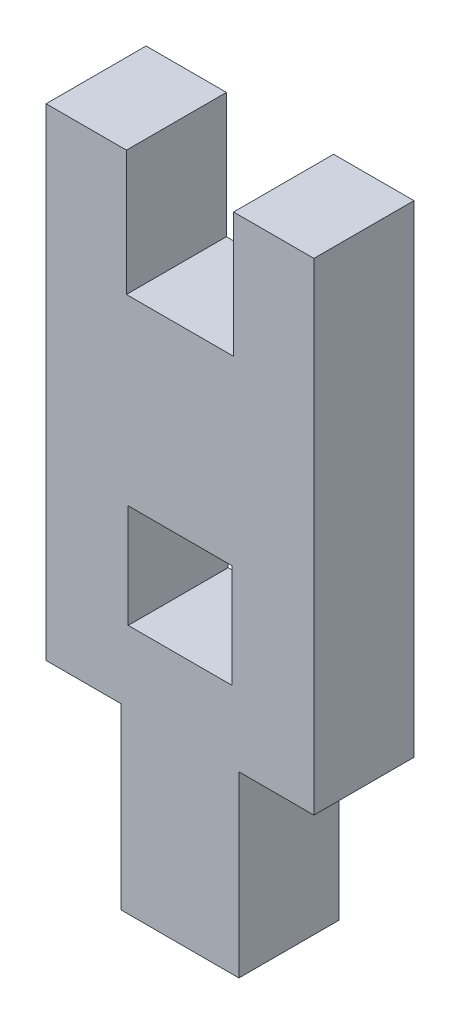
from build123d import *

# Parameters (mm, degrees)
SKETCH1_W           = 2.9
SKETCH1_H           = 2.9
BOSS_EXTRUDE1_DEPTH = 2.8


with BuildPart() as part:
    # Sketch1 → Boss-Extrude1 (new body)
    with BuildSketch(Plane.XY):
        Polygon((0, 0), (3.3, 0), (3.3, 5), (5.4, 5), (5.4, 15.5), (5.4, 18.5), (3.15, 18.5), (3.15, 15), (0.15, 15), (0.15, 18.5), (-2.1, 18.5), (-2.1, 12.5), (-2.1, 5), (0, 5), align=None)
        with Locations((1.65, 8.45)):
            Rectangle(SKETCH1_W, SKETCH1_H, mode=Mode.SUBTRACT)
    extrude(amount=BOSS_EXTRUDE1_DEPTH)


solid = part.part
